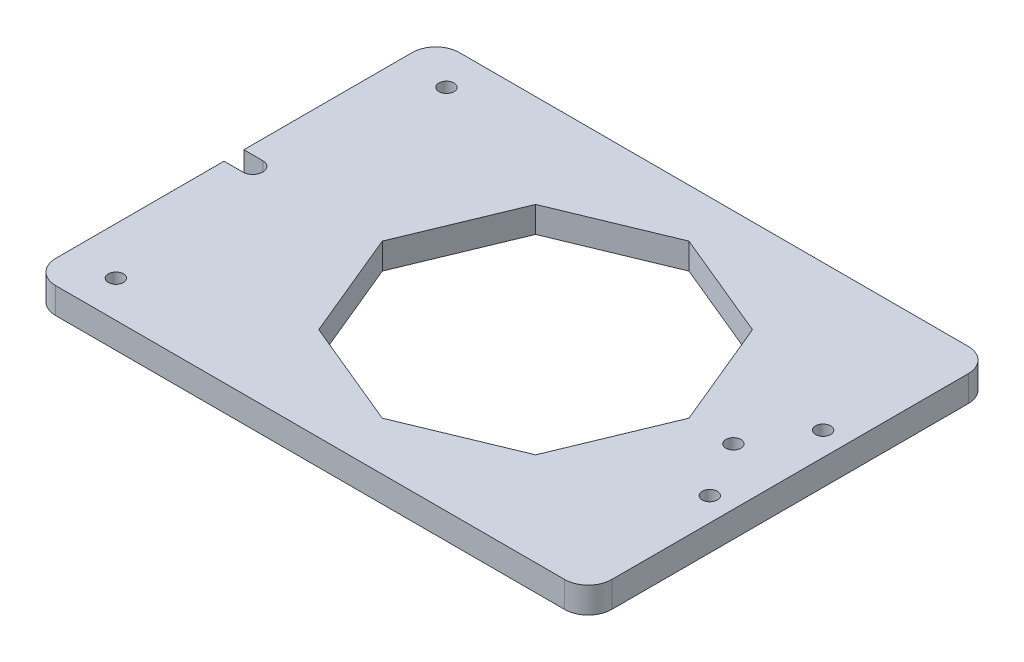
ISO-10303-21;
HEADER;
FILE_DESCRIPTION(('STEP AP214'),'2;1');
FILE_NAME('part.step','',(''),(''),'','','');
FILE_SCHEMA(('AUTOMOTIVE_DESIGN { 1 0 10303 214 1 1 1 1 }'));
ENDSEC;
DATA;
#1=APPLICATION_CONTEXT('core data for automotive mechanical design processes');
#2=APPLICATION_PROTOCOL_DEFINITION('international standard','automotive_design',2000,#1);
#3=PRODUCT_CONTEXT('',#1,'mechanical');
#4=PRODUCT('Part','Part','',(#3));
#5=PRODUCT_RELATED_PRODUCT_CATEGORY('part','',(#4));
#6=PRODUCT_DEFINITION_FORMATION('','',#4);
#7=PRODUCT_DEFINITION_CONTEXT('part definition',#1,'design');
#8=PRODUCT_DEFINITION('design','',#6,#7);
#9=PRODUCT_DEFINITION_SHAPE('','',#8);
#10=(LENGTH_UNIT() NAMED_UNIT(*) SI_UNIT(.MILLI.,.METRE.));
#11=(NAMED_UNIT(*) PLANE_ANGLE_UNIT() SI_UNIT($,.RADIAN.));
#12=(NAMED_UNIT(*) SI_UNIT($,.STERADIAN.) SOLID_ANGLE_UNIT());
#13=UNCERTAINTY_MEASURE_WITH_UNIT(LENGTH_MEASURE(1.E-05),#10,'distance_accuracy_value','');
#14=(GEOMETRIC_REPRESENTATION_CONTEXT(3) GLOBAL_UNCERTAINTY_ASSIGNED_CONTEXT((#13)) GLOBAL_UNIT_ASSIGNED_CONTEXT((#10,
#11,#12)) REPRESENTATION_CONTEXT('',''));
#15=CARTESIAN_POINT('',(0.,0.,0.));
#16=DIRECTION('',(0.,0.,1.));
#17=DIRECTION('',(1.,0.,0.));
#18=AXIS2_PLACEMENT_3D('',#15,#16,#17);
#19=CARTESIAN_POINT('',(-59.88,5.5,0.));
#20=DIRECTION('',(0.,1.,0.));
#21=DIRECTION('',(0.,0.,1.));
#22=AXIS2_PLACEMENT_3D('',#19,#20,#21);
#23=PLANE('',#22);
#24=CARTESIAN_POINT('',(-53.88,5.5,-35.));
#25=DIRECTION('',(0.,1.,0.));
#26=DIRECTION('',(0.,0.,1.));
#27=AXIS2_PLACEMENT_3D('',#24,#25,#26);
#28=CIRCLE('',#27,1.6);
#29=CARTESIAN_POINT('',(-53.88,5.5,-33.4));
#30=VERTEX_POINT('',#29);
#31=EDGE_CURVE('E465',#30,#30,#28,.T.);
#32=ORIENTED_EDGE('',*,*,#31,.F.);
#33=EDGE_LOOP('',(#32));
#34=FACE_BOUND('',#33,.T.);
#35=CARTESIAN_POINT('',(48.88,5.5,12.));
#36=DIRECTION('',(0.,1.,0.));
#37=DIRECTION('',(0.,0.,1.));
#38=AXIS2_PLACEMENT_3D('',#35,#36,#37);
#39=CIRCLE('',#38,1.6);
#40=CARTESIAN_POINT('',(48.88,5.5,13.6));
#41=VERTEX_POINT('',#40);
#42=EDGE_CURVE('E477',#41,#41,#39,.T.);
#43=ORIENTED_EDGE('',*,*,#42,.F.);
#44=EDGE_LOOP('',(#43));
#45=FACE_BOUND('',#44,.T.);
#46=DIRECTION('',(-0.923879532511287,0.,-0.382683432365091));
#47=VECTOR('',#46,1.);
#48=CARTESIAN_POINT('',(11.4805029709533,5.5,-27.71638597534));
#49=LINE('',#48,#47);
#50=CARTESIAN_POINT('',(22.9610059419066,5.5,-22.9610059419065));
#51=VERTEX_POINT('',#50);
#52=CARTESIAN_POINT('',(0.,5.5,-32.4717660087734));
#53=VERTEX_POINT('',#52);
#54=EDGE_CURVE('E200',#51,#53,#49,.T.);
#55=ORIENTED_EDGE('',*,*,#54,.F.);
#56=DIRECTION('',(-0.382683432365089,0.,-0.923879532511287));
#57=VECTOR('',#56,1.);
#58=CARTESIAN_POINT('',(27.71638597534,5.5,-11.4805029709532));
#59=LINE('',#58,#57);
#60=CARTESIAN_POINT('',(32.4717660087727,5.5,-1.70436581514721E-12));
#61=VERTEX_POINT('',#60);
#62=EDGE_CURVE('E185',#61,#51,#59,.T.);
#63=ORIENTED_EDGE('',*,*,#62,.F.);
#64=DIRECTION('',(0.382683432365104,0.,-0.923879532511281));
#65=VECTOR('',#64,1.);
#66=CARTESIAN_POINT('',(27.7163859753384,5.5,11.4805029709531));
#67=LINE('',#66,#65);
#68=CARTESIAN_POINT('',(22.9610059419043,5.5,22.9610059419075));
#69=VERTEX_POINT('',#68);
#70=EDGE_CURVE('E174',#69,#61,#67,.T.);
#71=ORIENTED_EDGE('',*,*,#70,.F.);
#72=DIRECTION('',(0.923879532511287,0.,-0.382683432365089));
#73=VECTOR('',#72,1.);
#74=CARTESIAN_POINT('',(0.,5.5,32.4717660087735));
#75=LINE('',#74,#73);
#76=CARTESIAN_POINT('',(0.,5.5,32.4717660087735));
#77=VERTEX_POINT('',#76);
#78=EDGE_CURVE('E213',#77,#69,#75,.T.);
#79=ORIENTED_EDGE('',*,*,#78,.F.);
#80=DIRECTION('',(0.923879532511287,0.,0.382683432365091));
#81=VECTOR('',#80,1.);
#82=CARTESIAN_POINT('',(-11.4805029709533,5.5,27.71638597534));
#83=LINE('',#82,#81);
#84=CARTESIAN_POINT('',(-22.9610059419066,5.5,22.9610059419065));
#85=VERTEX_POINT('',#84);
#86=EDGE_CURVE('E211',#85,#77,#83,.T.);
#87=ORIENTED_EDGE('',*,*,#86,.F.);
#88=DIRECTION('',(0.382683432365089,0.,0.923879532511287));
#89=VECTOR('',#88,1.);
#90=CARTESIAN_POINT('',(-27.71638597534,5.5,11.4805029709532));
#91=LINE('',#90,#89);
#92=CARTESIAN_POINT('',(-32.4717660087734,5.5,0.));
#93=VERTEX_POINT('',#92);
#94=EDGE_CURVE('E209',#93,#85,#91,.T.);
#95=ORIENTED_EDGE('',*,*,#94,.F.);
#96=DIRECTION('',(-0.38268343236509,0.,0.923879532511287));
#97=VECTOR('',#96,1.);
#98=CARTESIAN_POINT('',(-27.71638597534,5.5,-11.4805029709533));
#99=LINE('',#98,#97);
#100=CARTESIAN_POINT('',(-22.9610059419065,5.5,-22.9610059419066));
#101=VERTEX_POINT('',#100);
#102=EDGE_CURVE('E207',#101,#93,#99,.T.);
#103=ORIENTED_EDGE('',*,*,#102,.F.);
#104=DIRECTION('',(-0.923879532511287,0.,0.382683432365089));
#105=VECTOR('',#104,1.);
#106=CARTESIAN_POINT('',(-11.4805029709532,5.5,-27.71638597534));
#107=LINE('',#106,#105);
#108=EDGE_CURVE('E202',#53,#101,#107,.T.);
#109=ORIENTED_EDGE('',*,*,#108,.F.);
#110=EDGE_LOOP('',(#55,#63,#71,#79,#87,#95,#103,#109));
#111=FACE_BOUND('',#110,.T.);
#112=DIRECTION('',(-1.,0.,0.));
#113=VECTOR('',#112,1.);
#114=CARTESIAN_POINT('',(0.,5.5,-42.74));
#115=LINE('',#114,#113);
#116=CARTESIAN_POINT('',(48.88,5.5,-42.74));
#117=VERTEX_POINT('',#116);
#118=CARTESIAN_POINT('',(-58.88,5.5,-42.74));
#119=VERTEX_POINT('',#118);
#120=EDGE_CURVE('E255',#117,#119,#115,.T.);
#121=ORIENTED_EDGE('',*,*,#120,.T.);
#122=CARTESIAN_POINT('',(-58.88,5.5,-37.74));
#123=DIRECTION('',(0.,1.,0.));
#124=DIRECTION('',(0.,0.,1.));
#125=AXIS2_PLACEMENT_3D('',#122,#123,#124);
#126=CIRCLE('',#125,5.);
#127=CARTESIAN_POINT('',(-63.88,5.5,-37.74));
#128=VERTEX_POINT('',#127);
#129=EDGE_CURVE('E321',#119,#128,#126,.T.);
#130=ORIENTED_EDGE('',*,*,#129,.T.);
#131=DIRECTION('',(0.,0.,1.));
#132=VECTOR('',#131,1.);
#133=CARTESIAN_POINT('',(-63.88,5.5,-2.09999999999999));
#134=LINE('',#133,#132);
#135=CARTESIAN_POINT('',(-63.88,5.5,-2.09999999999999));
#136=VERTEX_POINT('',#135);
#137=EDGE_CURVE('E259',#128,#136,#134,.T.);
#138=ORIENTED_EDGE('',*,*,#137,.T.);
#139=DIRECTION('',(1.,0.,0.));
#140=VECTOR('',#139,1.);
#141=CARTESIAN_POINT('',(-59.88,5.5,-2.09999999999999));
#142=LINE('',#141,#140);
#143=CARTESIAN_POINT('',(-59.88,5.5,-2.09999999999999));
#144=VERTEX_POINT('',#143);
#145=EDGE_CURVE('E261',#136,#144,#142,.T.);
#146=ORIENTED_EDGE('',*,*,#145,.T.);
#147=CARTESIAN_POINT('',(-59.88,5.5,0.));
#148=DIRECTION('',(0.,-1.,0.));
#149=DIRECTION('',(0.,0.,1.));
#150=AXIS2_PLACEMENT_3D('',#147,#148,#149);
#151=CIRCLE('',#150,2.1);
#152=CARTESIAN_POINT('',(-59.88,5.5,2.1));
#153=VERTEX_POINT('',#152);
#154=EDGE_CURVE('E263',#144,#153,#151,.T.);
#155=ORIENTED_EDGE('',*,*,#154,.T.);
#156=DIRECTION('',(-1.,0.,0.));
#157=VECTOR('',#156,1.);
#158=CARTESIAN_POINT('',(-59.88,5.5,2.1));
#159=LINE('',#158,#157);
#160=CARTESIAN_POINT('',(-63.88,5.5,2.1));
#161=VERTEX_POINT('',#160);
#162=EDGE_CURVE('E265',#153,#161,#159,.T.);
#163=ORIENTED_EDGE('',*,*,#162,.T.);
#164=DIRECTION('',(0.,0.,1.));
#165=VECTOR('',#164,1.);
#166=CARTESIAN_POINT('',(-63.88,5.5,42.74));
#167=LINE('',#166,#165);
#168=CARTESIAN_POINT('',(-63.88,5.5,37.74));
#169=VERTEX_POINT('',#168);
#170=EDGE_CURVE('E267',#161,#169,#167,.T.);
#171=ORIENTED_EDGE('',*,*,#170,.T.);
#172=CARTESIAN_POINT('',(-58.88,5.5,37.74));
#173=DIRECTION('',(0.,1.,0.));
#174=DIRECTION('',(0.,0.,1.));
#175=AXIS2_PLACEMENT_3D('',#172,#173,#174);
#176=CIRCLE('',#175,5.);
#177=CARTESIAN_POINT('',(-58.88,5.5,42.74));
#178=VERTEX_POINT('',#177);
#179=EDGE_CURVE('E59',#169,#178,#176,.T.);
#180=ORIENTED_EDGE('',*,*,#179,.T.);
#181=DIRECTION('',(1.,0.,0.));
#182=VECTOR('',#181,1.);
#183=CARTESIAN_POINT('',(53.88,5.5,42.74));
#184=LINE('',#183,#182);
#185=CARTESIAN_POINT('',(48.88,5.5,42.74));
#186=VERTEX_POINT('',#185);
#187=EDGE_CURVE('E269',#178,#186,#184,.T.);
#188=ORIENTED_EDGE('',*,*,#187,.T.);
#189=CARTESIAN_POINT('',(48.88,5.5,37.74));
#190=DIRECTION('',(0.,1.,0.));
#191=DIRECTION('',(0.,0.,1.));
#192=AXIS2_PLACEMENT_3D('',#189,#190,#191);
#193=CIRCLE('',#192,5.);
#194=CARTESIAN_POINT('',(53.88,5.5,37.74));
#195=VERTEX_POINT('',#194);
#196=EDGE_CURVE('E316',#186,#195,#193,.T.);
#197=ORIENTED_EDGE('',*,*,#196,.T.);
#198=DIRECTION('',(0.,0.,-1.));
#199=VECTOR('',#198,1.);
#200=CARTESIAN_POINT('',(53.88,5.5,-42.74));
#201=LINE('',#200,#199);
#202=CARTESIAN_POINT('',(53.88,5.5,-37.74));
#203=VERTEX_POINT('',#202);
#204=EDGE_CURVE('E252',#195,#203,#201,.T.);
#205=ORIENTED_EDGE('',*,*,#204,.T.);
#206=CARTESIAN_POINT('',(48.88,5.5,-37.74));
#207=DIRECTION('',(0.,1.,0.));
#208=DIRECTION('',(0.,0.,1.));
#209=AXIS2_PLACEMENT_3D('',#206,#207,#208);
#210=CIRCLE('',#209,5.);
#211=EDGE_CURVE('E319',#203,#117,#210,.T.);
#212=ORIENTED_EDGE('',*,*,#211,.T.);
#213=EDGE_LOOP('',(#121,#130,#138,#146,#155,#163,#171,#180,#188,#197,#205,#212));
#214=FACE_BOUND('',#213,.T.);
#215=CARTESIAN_POINT('',(48.88,5.5,-12.));
#216=DIRECTION('',(0.,1.,0.));
#217=DIRECTION('',(0.,0.,1.));
#218=AXIS2_PLACEMENT_3D('',#215,#216,#217);
#219=CIRCLE('',#218,1.6);
#220=CARTESIAN_POINT('',(48.88,5.5,-10.4));
#221=VERTEX_POINT('',#220);
#222=EDGE_CURVE('E217',#221,#221,#219,.T.);
#223=ORIENTED_EDGE('',*,*,#222,.F.);
#224=EDGE_LOOP('',(#223));
#225=FACE_BOUND('',#224,.T.);
#226=CARTESIAN_POINT('',(41.880000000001,5.5,0.));
#227=DIRECTION('',(0.,1.,0.));
#228=DIRECTION('',(0.,0.,1.));
#229=AXIS2_PLACEMENT_3D('',#226,#227,#228);
#230=CIRCLE('',#229,1.5999999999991);
#231=CARTESIAN_POINT('',(41.880000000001,5.5,1.5999999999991));
#232=VERTEX_POINT('',#231);
#233=EDGE_CURVE('E471',#232,#232,#230,.T.);
#234=ORIENTED_EDGE('',*,*,#233,.F.);
#235=EDGE_LOOP('',(#234));
#236=FACE_BOUND('',#235,.T.);
#237=CARTESIAN_POINT('',(-53.88,5.5,35.));
#238=DIRECTION('',(0.,1.,0.));
#239=DIRECTION('',(0.,0.,1.));
#240=AXIS2_PLACEMENT_3D('',#237,#238,#239);
#241=CIRCLE('',#240,1.6);
#242=CARTESIAN_POINT('',(-53.88,5.5,36.6));
#243=VERTEX_POINT('',#242);
#244=EDGE_CURVE('E456',#243,#243,#241,.T.);
#245=ORIENTED_EDGE('',*,*,#244,.F.);
#246=EDGE_LOOP('',(#245));
#247=FACE_BOUND('',#246,.T.);
#248=ADVANCED_FACE('F37',(#34,#45,#111,#214,#225,#236,#247),#23,.T.);
#249=CARTESIAN_POINT('',(-59.88,0.,0.));
#250=DIRECTION('',(0.,1.,0.));
#251=DIRECTION('',(0.,0.,1.));
#252=AXIS2_PLACEMENT_3D('',#249,#250,#251);
#253=PLANE('',#252);
#254=DIRECTION('',(0.,0.,1.));
#255=VECTOR('',#254,1.);
#256=CARTESIAN_POINT('',(-63.88,0.,-2.09999999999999));
#257=LINE('',#256,#255);
#258=CARTESIAN_POINT('',(-63.88,0.,-37.74));
#259=VERTEX_POINT('',#258);
#260=CARTESIAN_POINT('',(-63.88,0.,-2.09999999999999));
#261=VERTEX_POINT('',#260);
#262=EDGE_CURVE('E277',#259,#261,#257,.T.);
#263=ORIENTED_EDGE('',*,*,#262,.F.);
#264=CARTESIAN_POINT('',(-58.88,0.,-37.74));
#265=DIRECTION('',(0.,1.,0.));
#266=DIRECTION('',(0.,0.,1.));
#267=AXIS2_PLACEMENT_3D('',#264,#265,#266);
#268=CIRCLE('',#267,5.);
#269=CARTESIAN_POINT('',(-58.88,0.,-42.74));
#270=VERTEX_POINT('',#269);
#271=EDGE_CURVE('E309',#259,#270,#268,.F.);
#272=ORIENTED_EDGE('',*,*,#271,.T.);
#273=DIRECTION('',(-1.,0.,0.));
#274=VECTOR('',#273,1.);
#275=CARTESIAN_POINT('',(-63.88,0.,-42.74));
#276=LINE('',#275,#274);
#277=CARTESIAN_POINT('',(48.88,0.,-42.74));
#278=VERTEX_POINT('',#277);
#279=EDGE_CURVE('E274',#278,#270,#276,.T.);
#280=ORIENTED_EDGE('',*,*,#279,.F.);
#281=CARTESIAN_POINT('',(48.88,0.,-37.74));
#282=DIRECTION('',(0.,1.,0.));
#283=DIRECTION('',(0.,0.,1.));
#284=AXIS2_PLACEMENT_3D('',#281,#282,#283);
#285=CIRCLE('',#284,5.);
#286=CARTESIAN_POINT('',(53.88,0.,-37.74));
#287=VERTEX_POINT('',#286);
#288=EDGE_CURVE('E307',#278,#287,#285,.F.);
#289=ORIENTED_EDGE('',*,*,#288,.T.);
#290=DIRECTION('',(0.,0.,-1.));
#291=VECTOR('',#290,1.);
#292=CARTESIAN_POINT('',(53.88,0.,-42.74));
#293=LINE('',#292,#291);
#294=CARTESIAN_POINT('',(53.88,0.,37.74));
#295=VERTEX_POINT('',#294);
#296=EDGE_CURVE('E195',#295,#287,#293,.T.);
#297=ORIENTED_EDGE('',*,*,#296,.F.);
#298=CARTESIAN_POINT('',(48.88,0.,37.74));
#299=DIRECTION('',(0.,1.,0.));
#300=DIRECTION('',(0.,0.,1.));
#301=AXIS2_PLACEMENT_3D('',#298,#299,#300);
#302=CIRCLE('',#301,5.);
#303=CARTESIAN_POINT('',(48.88,0.,42.74));
#304=VERTEX_POINT('',#303);
#305=EDGE_CURVE('E303',#295,#304,#302,.F.);
#306=ORIENTED_EDGE('',*,*,#305,.T.);
#307=DIRECTION('',(1.,0.,0.));
#308=VECTOR('',#307,1.);
#309=CARTESIAN_POINT('',(53.88,0.,42.74));
#310=LINE('',#309,#308);
#311=CARTESIAN_POINT('',(-58.88,0.,42.74));
#312=VERTEX_POINT('',#311);
#313=EDGE_CURVE('E256',#312,#304,#310,.T.);
#314=ORIENTED_EDGE('',*,*,#313,.F.);
#315=CARTESIAN_POINT('',(-58.88,0.,37.74));
#316=DIRECTION('',(0.,1.,0.));
#317=DIRECTION('',(0.,0.,1.));
#318=AXIS2_PLACEMENT_3D('',#315,#316,#317);
#319=CIRCLE('',#318,5.);
#320=CARTESIAN_POINT('',(-63.88,0.,37.74));
#321=VERTEX_POINT('',#320);
#322=EDGE_CURVE('E305',#312,#321,#319,.F.);
#323=ORIENTED_EDGE('',*,*,#322,.T.);
#324=DIRECTION('',(0.,0.,1.));
#325=VECTOR('',#324,1.);
#326=CARTESIAN_POINT('',(-63.88,0.,42.74));
#327=LINE('',#326,#325);
#328=CARTESIAN_POINT('',(-63.88,0.,2.1));
#329=VERTEX_POINT('',#328);
#330=EDGE_CURVE('E285',#329,#321,#327,.T.);
#331=ORIENTED_EDGE('',*,*,#330,.F.);
#332=DIRECTION('',(-1.,0.,0.));
#333=VECTOR('',#332,1.);
#334=CARTESIAN_POINT('',(-59.88,0.,2.1));
#335=LINE('',#334,#333);
#336=CARTESIAN_POINT('',(-59.88,0.,2.1));
#337=VERTEX_POINT('',#336);
#338=EDGE_CURVE('E283',#337,#329,#335,.T.);
#339=ORIENTED_EDGE('',*,*,#338,.F.);
#340=CARTESIAN_POINT('',(-59.88,0.,0.));
#341=DIRECTION('',(0.,-1.,0.));
#342=DIRECTION('',(0.,0.,1.));
#343=AXIS2_PLACEMENT_3D('',#340,#341,#342);
#344=CIRCLE('',#343,2.1);
#345=CARTESIAN_POINT('',(-59.88,0.,-2.09999999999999));
#346=VERTEX_POINT('',#345);
#347=EDGE_CURVE('E281',#346,#337,#344,.T.);
#348=ORIENTED_EDGE('',*,*,#347,.F.);
#349=DIRECTION('',(1.,0.,0.));
#350=VECTOR('',#349,1.);
#351=CARTESIAN_POINT('',(-59.88,0.,-2.09999999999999));
#352=LINE('',#351,#350);
#353=EDGE_CURVE('E279',#261,#346,#352,.T.);
#354=ORIENTED_EDGE('',*,*,#353,.F.);
#355=EDGE_LOOP('',(#263,#272,#280,#289,#297,#306,#314,#323,#331,#339,#348,#354));
#356=FACE_BOUND('',#355,.T.);
#357=DIRECTION('',(-0.382683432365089,0.,-0.923879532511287));
#358=VECTOR('',#357,1.);
#359=CARTESIAN_POINT('',(25.43277195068,0.,-16.9936349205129));
#360=LINE('',#359,#358);
#361=CARTESIAN_POINT('',(32.4717660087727,0.,-1.70002900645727E-12));
#362=VERTEX_POINT('',#361);
#363=CARTESIAN_POINT('',(22.9610059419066,0.,-22.9610059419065));
#364=VERTEX_POINT('',#363);
#365=EDGE_CURVE('E193',#362,#364,#360,.T.);
#366=ORIENTED_EDGE('',*,*,#365,.T.);
#367=DIRECTION('',(-0.923879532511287,0.,-0.38268343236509));
#368=VECTOR('',#367,1.);
#369=CARTESIAN_POINT('',(11.4805029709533,0.,-27.71638597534));
#370=LINE('',#369,#368);
#371=CARTESIAN_POINT('',(0.,0.,-32.4717660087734));
#372=VERTEX_POINT('',#371);
#373=EDGE_CURVE('E216',#364,#372,#370,.T.);
#374=ORIENTED_EDGE('',*,*,#373,.T.);
#375=DIRECTION('',(-0.923879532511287,0.,0.382683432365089));
#376=VECTOR('',#375,1.);
#377=CARTESIAN_POINT('',(-11.4805029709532,0.,-27.71638597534));
#378=LINE('',#377,#376);
#379=CARTESIAN_POINT('',(-22.9610059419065,0.,-22.9610059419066));
#380=VERTEX_POINT('',#379);
#381=EDGE_CURVE('E220',#372,#380,#378,.T.);
#382=ORIENTED_EDGE('',*,*,#381,.T.);
#383=DIRECTION('',(-0.38268343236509,0.,0.923879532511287));
#384=VECTOR('',#383,1.);
#385=CARTESIAN_POINT('',(-27.71638597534,0.,-11.4805029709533));
#386=LINE('',#385,#384);
#387=CARTESIAN_POINT('',(-32.4717660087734,0.,0.));
#388=VERTEX_POINT('',#387);
#389=EDGE_CURVE('E223',#380,#388,#386,.T.);
#390=ORIENTED_EDGE('',*,*,#389,.T.);
#391=DIRECTION('',(0.382683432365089,0.,0.923879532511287));
#392=VECTOR('',#391,1.);
#393=CARTESIAN_POINT('',(-27.71638597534,0.,11.4805029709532));
#394=LINE('',#393,#392);
#395=CARTESIAN_POINT('',(-22.9610059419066,0.,22.9610059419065));
#396=VERTEX_POINT('',#395);
#397=EDGE_CURVE('E226',#388,#396,#394,.T.);
#398=ORIENTED_EDGE('',*,*,#397,.T.);
#399=DIRECTION('',(0.923879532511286,0.,0.382683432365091));
#400=VECTOR('',#399,1.);
#401=CARTESIAN_POINT('',(-11.4805029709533,0.,27.71638597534));
#402=LINE('',#401,#400);
#403=CARTESIAN_POINT('',(0.,0.,32.4717660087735));
#404=VERTEX_POINT('',#403);
#405=EDGE_CURVE('E229',#396,#404,#402,.T.);
#406=ORIENTED_EDGE('',*,*,#405,.T.);
#407=DIRECTION('',(0.923879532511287,0.,-0.382683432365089));
#408=VECTOR('',#407,1.);
#409=CARTESIAN_POINT('',(0.,0.,32.4717660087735));
#410=LINE('',#409,#408);
#411=CARTESIAN_POINT('',(22.9610059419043,0.,22.9610059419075));
#412=VERTEX_POINT('',#411);
#413=EDGE_CURVE('E232',#404,#412,#410,.T.);
#414=ORIENTED_EDGE('',*,*,#413,.T.);
#415=DIRECTION('',(0.382683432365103,0.,-0.923879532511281));
#416=VECTOR('',#415,1.);
#417=CARTESIAN_POINT('',(27.7163859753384,0.,11.4805029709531));
#418=LINE('',#417,#416);
#419=EDGE_CURVE('E186',#412,#362,#418,.T.);
#420=ORIENTED_EDGE('',*,*,#419,.T.);
#421=EDGE_LOOP('',(#366,#374,#382,#390,#398,#406,#414,#420));
#422=FACE_BOUND('',#421,.T.);
#423=CARTESIAN_POINT('',(48.88,0.,-12.));
#424=DIRECTION('',(0.,1.,0.));
#425=DIRECTION('',(0.,0.,1.));
#426=AXIS2_PLACEMENT_3D('',#423,#424,#425);
#427=CIRCLE('',#426,1.6);
#428=CARTESIAN_POINT('',(48.88,0.,-10.4));
#429=VERTEX_POINT('',#428);
#430=EDGE_CURVE('E480',#429,#429,#427,.T.);
#431=ORIENTED_EDGE('',*,*,#430,.T.);
#432=EDGE_LOOP('',(#431));
#433=FACE_BOUND('',#432,.T.);
#434=CARTESIAN_POINT('',(48.88,0.,12.));
#435=DIRECTION('',(0.,1.,0.));
#436=DIRECTION('',(0.,0.,1.));
#437=AXIS2_PLACEMENT_3D('',#434,#435,#436);
#438=CIRCLE('',#437,1.6);
#439=CARTESIAN_POINT('',(48.88,0.,13.6));
#440=VERTEX_POINT('',#439);
#441=EDGE_CURVE('E474',#440,#440,#438,.T.);
#442=ORIENTED_EDGE('',*,*,#441,.T.);
#443=EDGE_LOOP('',(#442));
#444=FACE_BOUND('',#443,.T.);
#445=CARTESIAN_POINT('',(41.880000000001,0.,0.));
#446=DIRECTION('',(0.,1.,0.));
#447=DIRECTION('',(0.,0.,1.));
#448=AXIS2_PLACEMENT_3D('',#445,#446,#447);
#449=CIRCLE('',#448,1.5999999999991);
#450=CARTESIAN_POINT('',(41.880000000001,0.,1.5999999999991));
#451=VERTEX_POINT('',#450);
#452=EDGE_CURVE('E468',#451,#451,#449,.T.);
#453=ORIENTED_EDGE('',*,*,#452,.T.);
#454=EDGE_LOOP('',(#453));
#455=FACE_BOUND('',#454,.T.);
#456=CARTESIAN_POINT('',(-53.88,0.,-35.));
#457=DIRECTION('',(0.,1.,0.));
#458=DIRECTION('',(0.,0.,1.));
#459=AXIS2_PLACEMENT_3D('',#456,#457,#458);
#460=CIRCLE('',#459,1.6);
#461=CARTESIAN_POINT('',(-53.88,0.,-33.4));
#462=VERTEX_POINT('',#461);
#463=EDGE_CURVE('E462',#462,#462,#460,.T.);
#464=ORIENTED_EDGE('',*,*,#463,.T.);
#465=EDGE_LOOP('',(#464));
#466=FACE_BOUND('',#465,.T.);
#467=CARTESIAN_POINT('',(-53.88,0.,35.));
#468=DIRECTION('',(0.,1.,0.));
#469=DIRECTION('',(0.,0.,1.));
#470=AXIS2_PLACEMENT_3D('',#467,#468,#469);
#471=CIRCLE('',#470,1.6);
#472=CARTESIAN_POINT('',(-53.88,0.,36.6));
#473=VERTEX_POINT('',#472);
#474=EDGE_CURVE('E459',#473,#473,#471,.T.);
#475=ORIENTED_EDGE('',*,*,#474,.T.);
#476=EDGE_LOOP('',(#475));
#477=FACE_BOUND('',#476,.T.);
#478=ADVANCED_FACE('F335',(#356,#422,#433,#444,#455,#466,#477),#253,.F.);
#479=CARTESIAN_POINT('',(53.88,5.5,-42.74));
#480=DIRECTION('',(-1.,0.,0.));
#481=DIRECTION('',(0.,0.,1.));
#482=AXIS2_PLACEMENT_3D('',#479,#480,#481);
#483=PLANE('',#482);
#484=ORIENTED_EDGE('',*,*,#296,.T.);
#485=DIRECTION('',(0.,-1.,0.));
#486=VECTOR('',#485,1.);
#487=CARTESIAN_POINT('',(53.88,5.5,-37.74));
#488=LINE('',#487,#486);
#489=EDGE_CURVE('E326',#287,#203,#488,.F.);
#490=ORIENTED_EDGE('',*,*,#489,.T.);
#491=ORIENTED_EDGE('',*,*,#204,.F.);
#492=DIRECTION('',(0.,-1.,0.));
#493=VECTOR('',#492,1.);
#494=CARTESIAN_POINT('',(53.88,5.5,37.74));
#495=LINE('',#494,#493);
#496=EDGE_CURVE('E323',#195,#295,#495,.T.);
#497=ORIENTED_EDGE('',*,*,#496,.T.);
#498=EDGE_LOOP('',(#484,#490,#491,#497));
#499=FACE_BOUND('',#498,.T.);
#500=ADVANCED_FACE('F344',(#499),#483,.F.);
#501=CARTESIAN_POINT('',(-63.88,5.5,-42.74));
#502=DIRECTION('',(0.,0.,1.));
#503=DIRECTION('',(1.,0.,0.));
#504=AXIS2_PLACEMENT_3D('',#501,#502,#503);
#505=PLANE('',#504);
#506=ORIENTED_EDGE('',*,*,#279,.T.);
#507=DIRECTION('',(0.,-1.,0.));
#508=VECTOR('',#507,1.);
#509=CARTESIAN_POINT('',(-58.88,5.5,-42.74));
#510=LINE('',#509,#508);
#511=EDGE_CURVE('E314',#270,#119,#510,.F.);
#512=ORIENTED_EDGE('',*,*,#511,.T.);
#513=ORIENTED_EDGE('',*,*,#120,.F.);
#514=DIRECTION('',(0.,-1.,0.));
#515=VECTOR('',#514,1.);
#516=CARTESIAN_POINT('',(48.88,5.5,-42.74));
#517=LINE('',#516,#515);
#518=EDGE_CURVE('E311',#117,#278,#517,.T.);
#519=ORIENTED_EDGE('',*,*,#518,.T.);
#520=EDGE_LOOP('',(#506,#512,#513,#519));
#521=FACE_BOUND('',#520,.T.);
#522=ADVANCED_FACE('F354',(#521),#505,.F.);
#523=CARTESIAN_POINT('',(-63.88,5.5,-2.09999999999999));
#524=DIRECTION('',(1.,0.,0.));
#525=DIRECTION('',(0.,0.,-1.));
#526=AXIS2_PLACEMENT_3D('',#523,#524,#525);
#527=PLANE('',#526);
#528=ORIENTED_EDGE('',*,*,#137,.F.);
#529=DIRECTION('',(0.,-1.,0.));
#530=VECTOR('',#529,1.);
#531=CARTESIAN_POINT('',(-63.88,5.5,-37.74));
#532=LINE('',#531,#530);
#533=EDGE_CURVE('E300',#128,#259,#532,.T.);
#534=ORIENTED_EDGE('',*,*,#533,.T.);
#535=ORIENTED_EDGE('',*,*,#262,.T.);
#536=DIRECTION('',(0.,-1.,0.));
#537=VECTOR('',#536,1.);
#538=CARTESIAN_POINT('',(-63.88,5.5,-2.09999999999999));
#539=LINE('',#538,#537);
#540=EDGE_CURVE('E297',#136,#261,#539,.T.);
#541=ORIENTED_EDGE('',*,*,#540,.F.);
#542=EDGE_LOOP('',(#528,#534,#535,#541));
#543=FACE_BOUND('',#542,.T.);
#544=ADVANCED_FACE('F363',(#543),#527,.F.);
#545=CARTESIAN_POINT('',(-59.88,5.5,-2.09999999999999));
#546=DIRECTION('',(0.,0.,-1.));
#547=DIRECTION('',(-1.,0.,0.));
#548=AXIS2_PLACEMENT_3D('',#545,#546,#547);
#549=PLANE('',#548);
#550=ORIENTED_EDGE('',*,*,#353,.T.);
#551=DIRECTION('',(0.,-1.,0.));
#552=VECTOR('',#551,1.);
#553=CARTESIAN_POINT('',(-59.88,5.5,-2.09999999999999));
#554=LINE('',#553,#552);
#555=EDGE_CURVE('E294',#144,#346,#554,.T.);
#556=ORIENTED_EDGE('',*,*,#555,.F.);
#557=ORIENTED_EDGE('',*,*,#145,.F.);
#558=ORIENTED_EDGE('',*,*,#540,.T.);
#559=EDGE_LOOP('',(#550,#556,#557,#558));
#560=FACE_BOUND('',#559,.T.);
#561=ADVANCED_FACE('F370',(#560),#549,.F.);
#562=CARTESIAN_POINT('',(-59.88,5.5,0.));
#563=DIRECTION('',(0.,-1.,0.));
#564=DIRECTION('',(0.,0.,-1.));
#565=AXIS2_PLACEMENT_3D('',#562,#563,#564);
#566=CYLINDRICAL_SURFACE('',#565,2.1);
#567=ORIENTED_EDGE('',*,*,#347,.T.);
#568=DIRECTION('',(0.,-1.,0.));
#569=VECTOR('',#568,1.);
#570=CARTESIAN_POINT('',(-59.88,5.5,2.1));
#571=LINE('',#570,#569);
#572=EDGE_CURVE('E291',#153,#337,#571,.T.);
#573=ORIENTED_EDGE('',*,*,#572,.F.);
#574=ORIENTED_EDGE('',*,*,#154,.F.);
#575=ORIENTED_EDGE('',*,*,#555,.T.);
#576=EDGE_LOOP('',(#567,#573,#574,#575));
#577=FACE_BOUND('',#576,.T.);
#578=ADVANCED_FACE('F373',(#577),#566,.F.);
#579=CARTESIAN_POINT('',(-59.88,5.5,2.1));
#580=DIRECTION('',(0.,0.,1.));
#581=DIRECTION('',(1.,0.,0.));
#582=AXIS2_PLACEMENT_3D('',#579,#580,#581);
#583=PLANE('',#582);
#584=ORIENTED_EDGE('',*,*,#338,.T.);
#585=DIRECTION('',(0.,-1.,0.));
#586=VECTOR('',#585,1.);
#587=CARTESIAN_POINT('',(-63.88,5.5,2.1));
#588=LINE('',#587,#586);
#589=EDGE_CURVE('E271',#161,#329,#588,.T.);
#590=ORIENTED_EDGE('',*,*,#589,.F.);
#591=ORIENTED_EDGE('',*,*,#162,.F.);
#592=ORIENTED_EDGE('',*,*,#572,.T.);
#593=EDGE_LOOP('',(#584,#590,#591,#592));
#594=FACE_BOUND('',#593,.T.);
#595=ADVANCED_FACE('F378',(#594),#583,.F.);
#596=CARTESIAN_POINT('',(-63.88,5.5,42.74));
#597=DIRECTION('',(1.,0.,0.));
#598=DIRECTION('',(0.,0.,-1.));
#599=AXIS2_PLACEMENT_3D('',#596,#597,#598);
#600=PLANE('',#599);
#601=ORIENTED_EDGE('',*,*,#330,.T.);
#602=DIRECTION('',(0.,-1.,0.));
#603=VECTOR('',#602,1.);
#604=CARTESIAN_POINT('',(-63.88,5.5,37.74));
#605=LINE('',#604,#603);
#606=EDGE_CURVE('E11',#321,#169,#605,.F.);
#607=ORIENTED_EDGE('',*,*,#606,.T.);
#608=ORIENTED_EDGE('',*,*,#170,.F.);
#609=ORIENTED_EDGE('',*,*,#589,.T.);
#610=EDGE_LOOP('',(#601,#607,#608,#609));
#611=FACE_BOUND('',#610,.T.);
#612=ADVANCED_FACE('F383',(#611),#600,.F.);
#613=CARTESIAN_POINT('',(53.88,5.5,42.74));
#614=DIRECTION('',(0.,0.,-1.));
#615=DIRECTION('',(-1.,0.,0.));
#616=AXIS2_PLACEMENT_3D('',#613,#614,#615);
#617=PLANE('',#616);
#618=ORIENTED_EDGE('',*,*,#187,.F.);
#619=DIRECTION('',(0.,-1.,0.));
#620=VECTOR('',#619,1.);
#621=CARTESIAN_POINT('',(-58.88,5.5,42.74));
#622=LINE('',#621,#620);
#623=EDGE_CURVE('E45',#178,#312,#622,.T.);
#624=ORIENTED_EDGE('',*,*,#623,.T.);
#625=ORIENTED_EDGE('',*,*,#313,.T.);
#626=DIRECTION('',(0.,-1.,0.));
#627=VECTOR('',#626,1.);
#628=CARTESIAN_POINT('',(48.88,5.5,42.74));
#629=LINE('',#628,#627);
#630=EDGE_CURVE('E52',#304,#186,#629,.F.);
#631=ORIENTED_EDGE('',*,*,#630,.T.);
#632=EDGE_LOOP('',(#618,#624,#625,#631));
#633=FACE_BOUND('',#632,.T.);
#634=ADVANCED_FACE('F331',(#633),#617,.F.);
#635=CARTESIAN_POINT('',(25.43277195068,5.5,-16.9936349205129));
#636=DIRECTION('',(-0.923879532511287,0.,0.382683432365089));
#637=DIRECTION('',(0.382683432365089,0.,0.923879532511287));
#638=AXIS2_PLACEMENT_3D('',#635,#636,#637);
#639=PLANE('',#638);
#640=ORIENTED_EDGE('',*,*,#365,.F.);
#641=DIRECTION('',(0.,-1.,0.));
#642=VECTOR('',#641,1.);
#643=CARTESIAN_POINT('',(32.4717660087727,5.5,-1.70436581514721E-12));
#644=LINE('',#643,#642);
#645=EDGE_CURVE('E178',#61,#362,#644,.T.);
#646=ORIENTED_EDGE('',*,*,#645,.F.);
#647=ORIENTED_EDGE('',*,*,#62,.T.);
#648=DIRECTION('',(0.,-1.,0.));
#649=VECTOR('',#648,1.);
#650=CARTESIAN_POINT('',(22.9610059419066,5.5,-22.9610059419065));
#651=LINE('',#650,#649);
#652=EDGE_CURVE('E196',#51,#364,#651,.T.);
#653=ORIENTED_EDGE('',*,*,#652,.T.);
#654=EDGE_LOOP('',(#640,#646,#647,#653));
#655=FACE_BOUND('',#654,.T.);
#656=ADVANCED_FACE('F189',(#655),#639,.T.);
#657=CARTESIAN_POINT('',(11.4805029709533,5.5,-27.71638597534));
#658=DIRECTION('',(-0.38268343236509,0.,0.923879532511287));
#659=DIRECTION('',(0.923879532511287,0.,0.38268343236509));
#660=AXIS2_PLACEMENT_3D('',#657,#658,#659);
#661=PLANE('',#660);
#662=ORIENTED_EDGE('',*,*,#373,.F.);
#663=ORIENTED_EDGE('',*,*,#652,.F.);
#664=ORIENTED_EDGE('',*,*,#54,.T.);
#665=DIRECTION('',(0.,-1.,0.));
#666=VECTOR('',#665,1.);
#667=CARTESIAN_POINT('',(0.,5.5,-32.4717660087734));
#668=LINE('',#667,#666);
#669=EDGE_CURVE('E248',#53,#372,#668,.T.);
#670=ORIENTED_EDGE('',*,*,#669,.T.);
#671=EDGE_LOOP('',(#662,#663,#664,#670));
#672=FACE_BOUND('',#671,.T.);
#673=ADVANCED_FACE('F404',(#672),#661,.T.);
#674=CARTESIAN_POINT('',(-11.4805029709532,5.5,-27.71638597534));
#675=DIRECTION('',(0.382683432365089,0.,0.923879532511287));
#676=DIRECTION('',(0.923879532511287,0.,-0.382683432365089));
#677=AXIS2_PLACEMENT_3D('',#674,#675,#676);
#678=PLANE('',#677);
#679=ORIENTED_EDGE('',*,*,#381,.F.);
#680=ORIENTED_EDGE('',*,*,#669,.F.);
#681=ORIENTED_EDGE('',*,*,#108,.T.);
#682=DIRECTION('',(0.,-1.,0.));
#683=VECTOR('',#682,1.);
#684=CARTESIAN_POINT('',(-22.9610059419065,5.5,-22.9610059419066));
#685=LINE('',#684,#683);
#686=EDGE_CURVE('E245',#101,#380,#685,.T.);
#687=ORIENTED_EDGE('',*,*,#686,.T.);
#688=EDGE_LOOP('',(#679,#680,#681,#687));
#689=FACE_BOUND('',#688,.T.);
#690=ADVANCED_FACE('F407',(#689),#678,.T.);
#691=CARTESIAN_POINT('',(-27.71638597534,5.5,-11.4805029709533));
#692=DIRECTION('',(0.923879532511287,0.,0.38268343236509));
#693=DIRECTION('',(0.38268343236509,0.,-0.923879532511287));
#694=AXIS2_PLACEMENT_3D('',#691,#692,#693);
#695=PLANE('',#694);
#696=ORIENTED_EDGE('',*,*,#389,.F.);
#697=ORIENTED_EDGE('',*,*,#686,.F.);
#698=ORIENTED_EDGE('',*,*,#102,.T.);
#699=DIRECTION('',(0.,-1.,0.));
#700=VECTOR('',#699,1.);
#701=CARTESIAN_POINT('',(-32.4717660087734,5.5,0.));
#702=LINE('',#701,#700);
#703=EDGE_CURVE('E242',#93,#388,#702,.T.);
#704=ORIENTED_EDGE('',*,*,#703,.T.);
#705=EDGE_LOOP('',(#696,#697,#698,#704));
#706=FACE_BOUND('',#705,.T.);
#707=ADVANCED_FACE('F411',(#706),#695,.T.);
#708=CARTESIAN_POINT('',(-27.71638597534,5.5,11.4805029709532));
#709=DIRECTION('',(0.923879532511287,0.,-0.382683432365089));
#710=DIRECTION('',(-0.382683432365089,0.,-0.923879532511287));
#711=AXIS2_PLACEMENT_3D('',#708,#709,#710);
#712=PLANE('',#711);
#713=ORIENTED_EDGE('',*,*,#397,.F.);
#714=ORIENTED_EDGE('',*,*,#703,.F.);
#715=ORIENTED_EDGE('',*,*,#94,.T.);
#716=DIRECTION('',(0.,-1.,0.));
#717=VECTOR('',#716,1.);
#718=CARTESIAN_POINT('',(-22.9610059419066,5.5,22.9610059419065));
#719=LINE('',#718,#717);
#720=EDGE_CURVE('E239',#85,#396,#719,.T.);
#721=ORIENTED_EDGE('',*,*,#720,.T.);
#722=EDGE_LOOP('',(#713,#714,#715,#721));
#723=FACE_BOUND('',#722,.T.);
#724=ADVANCED_FACE('F415',(#723),#712,.T.);
#725=CARTESIAN_POINT('',(-11.4805029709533,5.5,27.71638597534));
#726=DIRECTION('',(0.382683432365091,0.,-0.923879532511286));
#727=DIRECTION('',(-0.923879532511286,0.,-0.382683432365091));
#728=AXIS2_PLACEMENT_3D('',#725,#726,#727);
#729=PLANE('',#728);
#730=ORIENTED_EDGE('',*,*,#405,.F.);
#731=ORIENTED_EDGE('',*,*,#720,.F.);
#732=ORIENTED_EDGE('',*,*,#86,.T.);
#733=DIRECTION('',(0.,-1.,0.));
#734=VECTOR('',#733,1.);
#735=CARTESIAN_POINT('',(0.,5.5,32.4717660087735));
#736=LINE('',#735,#734);
#737=EDGE_CURVE('E237',#77,#404,#736,.T.);
#738=ORIENTED_EDGE('',*,*,#737,.T.);
#739=EDGE_LOOP('',(#730,#731,#732,#738));
#740=FACE_BOUND('',#739,.T.);
#741=ADVANCED_FACE('F419',(#740),#729,.T.);
#742=CARTESIAN_POINT('',(0.,5.5,32.4717660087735));
#743=DIRECTION('',(-0.382683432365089,0.,-0.923879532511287));
#744=DIRECTION('',(-0.923879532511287,0.,0.382683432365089));
#745=AXIS2_PLACEMENT_3D('',#742,#743,#744);
#746=PLANE('',#745);
#747=ORIENTED_EDGE('',*,*,#413,.F.);
#748=ORIENTED_EDGE('',*,*,#737,.F.);
#749=ORIENTED_EDGE('',*,*,#78,.T.);
#750=DIRECTION('',(0.,-1.,0.));
#751=VECTOR('',#750,1.);
#752=CARTESIAN_POINT('',(22.9610059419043,5.5,22.9610059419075));
#753=LINE('',#752,#751);
#754=EDGE_CURVE('E180',#69,#412,#753,.T.);
#755=ORIENTED_EDGE('',*,*,#754,.T.);
#756=EDGE_LOOP('',(#747,#748,#749,#755));
#757=FACE_BOUND('',#756,.T.);
#758=ADVANCED_FACE('F423',(#757),#746,.T.);
#759=CARTESIAN_POINT('',(27.7163859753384,5.5,11.4805029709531));
#760=DIRECTION('',(-0.923879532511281,0.,-0.382683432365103));
#761=DIRECTION('',(-0.382683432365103,0.,0.923879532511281));
#762=AXIS2_PLACEMENT_3D('',#759,#760,#761);
#763=PLANE('',#762);
#764=ORIENTED_EDGE('',*,*,#419,.F.);
#765=ORIENTED_EDGE('',*,*,#754,.F.);
#766=ORIENTED_EDGE('',*,*,#70,.T.);
#767=ORIENTED_EDGE('',*,*,#645,.T.);
#768=EDGE_LOOP('',(#764,#765,#766,#767));
#769=FACE_BOUND('',#768,.T.);
#770=ADVANCED_FACE('F177',(#769),#763,.T.);
#771=CARTESIAN_POINT('',(48.88,5.5,-12.));
#772=DIRECTION('',(0.,-1.,0.));
#773=DIRECTION('',(0.,0.,-1.));
#774=AXIS2_PLACEMENT_3D('',#771,#772,#773);
#775=CYLINDRICAL_SURFACE('',#774,1.6);
#776=ORIENTED_EDGE('',*,*,#222,.T.);
#777=EDGE_LOOP('',(#776));
#778=FACE_BOUND('',#777,.T.);
#779=ORIENTED_EDGE('',*,*,#430,.F.);
#780=EDGE_LOOP('',(#779));
#781=FACE_BOUND('',#780,.T.);
#782=ADVANCED_FACE('F430',(#778,#781),#775,.F.);
#783=CARTESIAN_POINT('',(48.88,5.5,12.));
#784=DIRECTION('',(0.,-1.,0.));
#785=DIRECTION('',(0.,0.,-1.));
#786=AXIS2_PLACEMENT_3D('',#783,#784,#785);
#787=CYLINDRICAL_SURFACE('',#786,1.6);
#788=ORIENTED_EDGE('',*,*,#42,.T.);
#789=EDGE_LOOP('',(#788));
#790=FACE_BOUND('',#789,.T.);
#791=ORIENTED_EDGE('',*,*,#441,.F.);
#792=EDGE_LOOP('',(#791));
#793=FACE_BOUND('',#792,.T.);
#794=ADVANCED_FACE('F433',(#790,#793),#787,.F.);
#795=CARTESIAN_POINT('',(41.880000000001,5.5,0.));
#796=DIRECTION('',(0.,-1.,0.));
#797=DIRECTION('',(0.,0.,-1.));
#798=AXIS2_PLACEMENT_3D('',#795,#796,#797);
#799=CYLINDRICAL_SURFACE('',#798,1.5999999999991);
#800=ORIENTED_EDGE('',*,*,#233,.T.);
#801=EDGE_LOOP('',(#800));
#802=FACE_BOUND('',#801,.T.);
#803=ORIENTED_EDGE('',*,*,#452,.F.);
#804=EDGE_LOOP('',(#803));
#805=FACE_BOUND('',#804,.T.);
#806=ADVANCED_FACE('F437',(#802,#805),#799,.F.);
#807=CARTESIAN_POINT('',(-53.88,5.5,-35.));
#808=DIRECTION('',(0.,-1.,0.));
#809=DIRECTION('',(0.,0.,-1.));
#810=AXIS2_PLACEMENT_3D('',#807,#808,#809);
#811=CYLINDRICAL_SURFACE('',#810,1.6);
#812=ORIENTED_EDGE('',*,*,#31,.T.);
#813=EDGE_LOOP('',(#812));
#814=FACE_BOUND('',#813,.T.);
#815=ORIENTED_EDGE('',*,*,#463,.F.);
#816=EDGE_LOOP('',(#815));
#817=FACE_BOUND('',#816,.T.);
#818=ADVANCED_FACE('F441',(#814,#817),#811,.F.);
#819=CARTESIAN_POINT('',(-53.88,5.5,35.));
#820=DIRECTION('',(0.,-1.,0.));
#821=DIRECTION('',(0.,0.,-1.));
#822=AXIS2_PLACEMENT_3D('',#819,#820,#821);
#823=CYLINDRICAL_SURFACE('',#822,1.6);
#824=ORIENTED_EDGE('',*,*,#244,.T.);
#825=EDGE_LOOP('',(#824));
#826=FACE_BOUND('',#825,.T.);
#827=ORIENTED_EDGE('',*,*,#474,.F.);
#828=EDGE_LOOP('',(#827));
#829=FACE_BOUND('',#828,.T.);
#830=ADVANCED_FACE('F445',(#826,#829),#823,.F.);
#831=CARTESIAN_POINT('',(-58.88,5.5,-37.74));
#832=DIRECTION('',(0.,-1.,0.));
#833=DIRECTION('',(0.,0.,-1.));
#834=AXIS2_PLACEMENT_3D('',#831,#832,#833);
#835=CYLINDRICAL_SURFACE('',#834,5.);
#836=ORIENTED_EDGE('',*,*,#129,.F.);
#837=ORIENTED_EDGE('',*,*,#511,.F.);
#838=ORIENTED_EDGE('',*,*,#271,.F.);
#839=ORIENTED_EDGE('',*,*,#533,.F.);
#840=EDGE_LOOP('',(#836,#837,#838,#839));
#841=FACE_BOUND('',#840,.T.);
#842=ADVANCED_FACE('F360',(#841),#835,.T.);
#843=CARTESIAN_POINT('',(48.88,5.5,-37.74));
#844=DIRECTION('',(0.,-1.,0.));
#845=DIRECTION('',(0.,0.,-1.));
#846=AXIS2_PLACEMENT_3D('',#843,#844,#845);
#847=CYLINDRICAL_SURFACE('',#846,5.);
#848=ORIENTED_EDGE('',*,*,#211,.F.);
#849=ORIENTED_EDGE('',*,*,#489,.F.);
#850=ORIENTED_EDGE('',*,*,#288,.F.);
#851=ORIENTED_EDGE('',*,*,#518,.F.);
#852=EDGE_LOOP('',(#848,#849,#850,#851));
#853=FACE_BOUND('',#852,.T.);
#854=ADVANCED_FACE('F351',(#853),#847,.T.);
#855=CARTESIAN_POINT('',(-58.88,5.5,37.74));
#856=DIRECTION('',(0.,-1.,0.));
#857=DIRECTION('',(0.,0.,-1.));
#858=AXIS2_PLACEMENT_3D('',#855,#856,#857);
#859=CYLINDRICAL_SURFACE('',#858,5.);
#860=ORIENTED_EDGE('',*,*,#179,.F.);
#861=ORIENTED_EDGE('',*,*,#606,.F.);
#862=ORIENTED_EDGE('',*,*,#322,.F.);
#863=ORIENTED_EDGE('',*,*,#623,.F.);
#864=EDGE_LOOP('',(#860,#861,#862,#863));
#865=FACE_BOUND('',#864,.T.);
#866=ADVANCED_FACE('F382',(#865),#859,.T.);
#867=CARTESIAN_POINT('',(48.88,5.5,37.74));
#868=DIRECTION('',(0.,-1.,0.));
#869=DIRECTION('',(0.,0.,-1.));
#870=AXIS2_PLACEMENT_3D('',#867,#868,#869);
#871=CYLINDRICAL_SURFACE('',#870,5.);
#872=ORIENTED_EDGE('',*,*,#196,.F.);
#873=ORIENTED_EDGE('',*,*,#630,.F.);
#874=ORIENTED_EDGE('',*,*,#305,.F.);
#875=ORIENTED_EDGE('',*,*,#496,.F.);
#876=EDGE_LOOP('',(#872,#873,#874,#875));
#877=FACE_BOUND('',#876,.T.);
#878=ADVANCED_FACE('F39',(#877),#871,.T.);
#879=CLOSED_SHELL('',(#248,#478,#500,#522,#544,#561,#578,#595,#612,#634,#656,#673,#690,#707,
#724,#741,#758,#770,#782,#794,#806,#818,#830,#842,#854,#866,#878));
#880=MANIFOLD_SOLID_BREP('B2',#879);
#881=ADVANCED_BREP_SHAPE_REPRESENTATION('',(#18,#880),#14);
#882=SHAPE_DEFINITION_REPRESENTATION(#9,#881);
ENDSEC;
END-ISO-10303-21;
